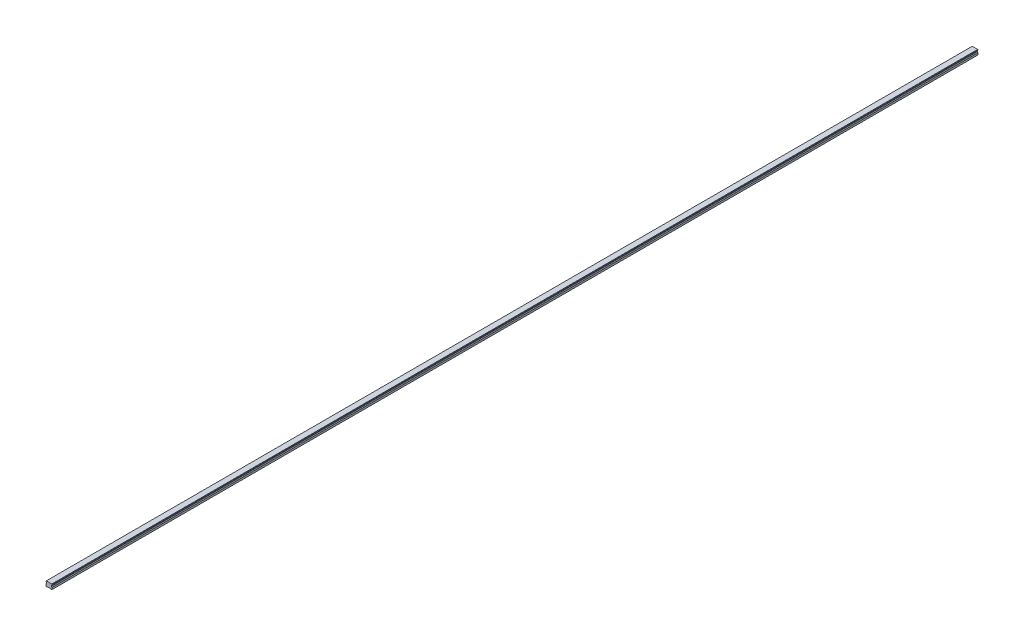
from build123d import *

# Parameters (mm, degrees)
SKETCH1_W           = 20
SKETCH1_H           = 16.3
BOSS_EXTRUDE1_DEPTH = 1520
CUT_EXTRUDE1_DEPTH  = 3041.060145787
CHAMFER1_SIZE       = 1
FILLET1_R           = 1
CUT_EXTRUDE2_DEPTH  = 3041.060145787
SKETCH5_R           = 3
SKETCH5_R_2         = 2.5
CUT_EXTRUDE5_DEPTH  = 10
SKETCH5_2_R         = 2.5
CUT_EXTRUDE6_DEPTH  = 13
LPATTERN2_COUNT     = 51
LPATTERN2_PITCH     = 60


with BuildPart() as part:
    # Sketch1 → Boss-Extrude1 (new, symmetric)
    with BuildSketch(Plane.XY):
        with Locations((0, 8.15)):
            Rectangle(SKETCH1_W, SKETCH1_H)
    extrude(amount=BOSS_EXTRUDE1_DEPTH, both=True)

    # Sketch2 → Cut-Extrude1 (cut, through all)
    with BuildSketch(Plane.XY.offset(1520)):
        Polygon((-10, 14.3), (-10, 7.3), (-7.666666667, 9.633333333), (-7.666666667, 11.966666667), align=None)
        Polygon((7.666666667, 11.966666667), (10, 14.3), (10, 7.3), (7.666666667, 9.633333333), align=None)
    extrude(amount=-CUT_EXTRUDE1_DEPTH, mode=Mode.SUBTRACT)

    # Chamfer1
    chamfer1_edges = [part.edges().sort_by_distance(p)[0] for p in [
        (-10, 16.3, 0),
        (10, 16.3, 0),
        (10, 0, 0),
        (-10, 0, 0),
    ]]
    chamfer(chamfer1_edges, length=CHAMFER1_SIZE)

    # Fillet1
    fillet1_edges = [part.edges().sort_by_distance(p)[0] for p in [
        (-7.666666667, 11.966666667, 0),
        (-7.666666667, 9.633333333, 0),
        (7.666666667, 9.633333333, 0),
        (7.666666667, 11.966666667, 0),
    ]]
    fillet(fillet1_edges, radius=FILLET1_R)

    # Sketch3 → Cut-Extrude2 (cut, through all)
    with BuildSketch(Plane.XY.offset(1520)):
        Polygon((-6, 0), (-5, 1), (5, 1), (6, 0), align=None)
    extrude(amount=-CUT_EXTRUDE2_DEPTH, mode=Mode.SUBTRACT)

    # Sketch5 → Cut-Extrude5 (cut)
    with BuildSketch(Plane.XZ.offset(-1)):
        with Locations(Location((0, 1500, 0), (0, 0, 270))):
            Circle(SKETCH5_R)
        with Locations(Location((0, 1500, 0), (0, 0, 270))):
            Circle(SKETCH5_R_2, mode=Mode.SUBTRACT)
    cut_extrude5 = extrude(amount=-CUT_EXTRUDE5_DEPTH, mode=Mode.SUBTRACT)

    # Sketch5_2 → Cut-Extrude6 (cut)
    with BuildSketch(Plane.XZ.offset(-1)):
        with Locations(Location((0, 1500, 0), (0, 0, 270))):
            Circle(SKETCH5_2_R)
    cut_extrude6 = extrude(amount=-CUT_EXTRUDE6_DEPTH, mode=Mode.SUBTRACT)

    # Cut-Extrude7 cone 1 section (on through the dimple's axis) → Cut-Extrude7 (revolve, cut)
    with BuildSketch(Plane(origin=(0, 14, 1500), x_dir=(0, 0, -1), z_dir=(1, 0, 0))):
        Polygon((0, 0), (2.5, 0), (0, 1.443375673), align=None)
    cut_extrude7 = revolve(axis=Axis((0, 14, 1500), (0, 1, 0)), mode=Mode.SUBTRACT)

    # LPattern2: Cut-Extrude5, Cut-Extrude6, Cut-Extrude7 ×51
    with Locations(*[(0, 0, -i * LPATTERN2_PITCH) for i in range(1, LPATTERN2_COUNT)]):
        add(cut_extrude5, mode=Mode.SUBTRACT)
        add(cut_extrude6, mode=Mode.SUBTRACT)
        add(cut_extrude7, mode=Mode.SUBTRACT)


solid = part.part
